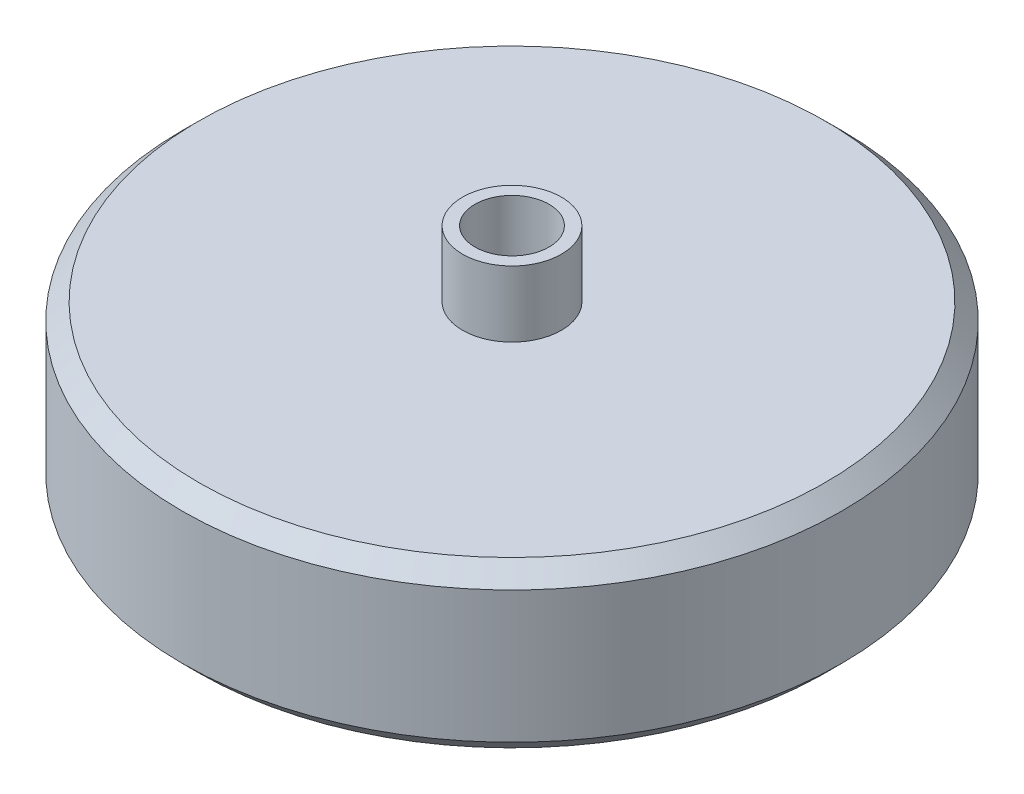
from build123d import *

# Parameters (mm, degrees)
SKETCH1_R      = 20
EXTRUDE1_DEPTH = 10
SKETCH2_R      = 3
EXTRUDE2_DEPTH = 4
EXTRUDE3_START = 4
SKETCH3_R      = 3
EXTRUDE3_DEPTH = 4
SKETCH4_R      = 2.25
EXTRUDE4_DEPTH = 34.526109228
CHAMFER1_SIZE  = 1


with BuildPart() as part:
    # Sketch1 → Extrude1 (new body)
    with BuildSketch(Plane(origin=(0, 0, 0), x_dir=(1, 0, 0), z_dir=(0, 1, 0))):
        with Locations(Location((0, 0, 0), (0, 0, 270))):
            Circle(SKETCH1_R)
    extrude(amount=EXTRUDE1_DEPTH)

    # Sketch2 → Extrude2 (add)
    with BuildSketch(Plane(origin=(0, 10, 0), x_dir=(1, 0, 0), z_dir=(0, 1, 0))):
        with Locations(Location((0, 0, 0), (0, 0, 270))):
            Circle(SKETCH2_R)
    extrude(amount=EXTRUDE2_DEPTH)

    # Sketch3 → Extrude3 (add)
    with BuildSketch(Plane.XZ.offset(EXTRUDE3_START)):
        with Locations(Location((0, 0, 0), (0, 0, 90))):
            Circle(SKETCH3_R)
    extrude(amount=-EXTRUDE3_DEPTH)

    # Sketch4 → Extrude4 (cut, through all)
    with BuildSketch(Plane(origin=(0, 14, 0), x_dir=(1, 0, 0), z_dir=(0, 1, 0))):
        with Locations(Location((0, 0, 0), (0, 0, 270))):
            Circle(SKETCH4_R)
    extrude(amount=-EXTRUDE4_DEPTH, mode=Mode.SUBTRACT)

    # Chamfer1
    chamfer1_edges = [part.edges().sort_by_distance(p)[0] for p in [
        (0, 0, -20),
        (0, 10, -20),
    ]]
    chamfer(chamfer1_edges, length=CHAMFER1_SIZE)


solid = part.part
